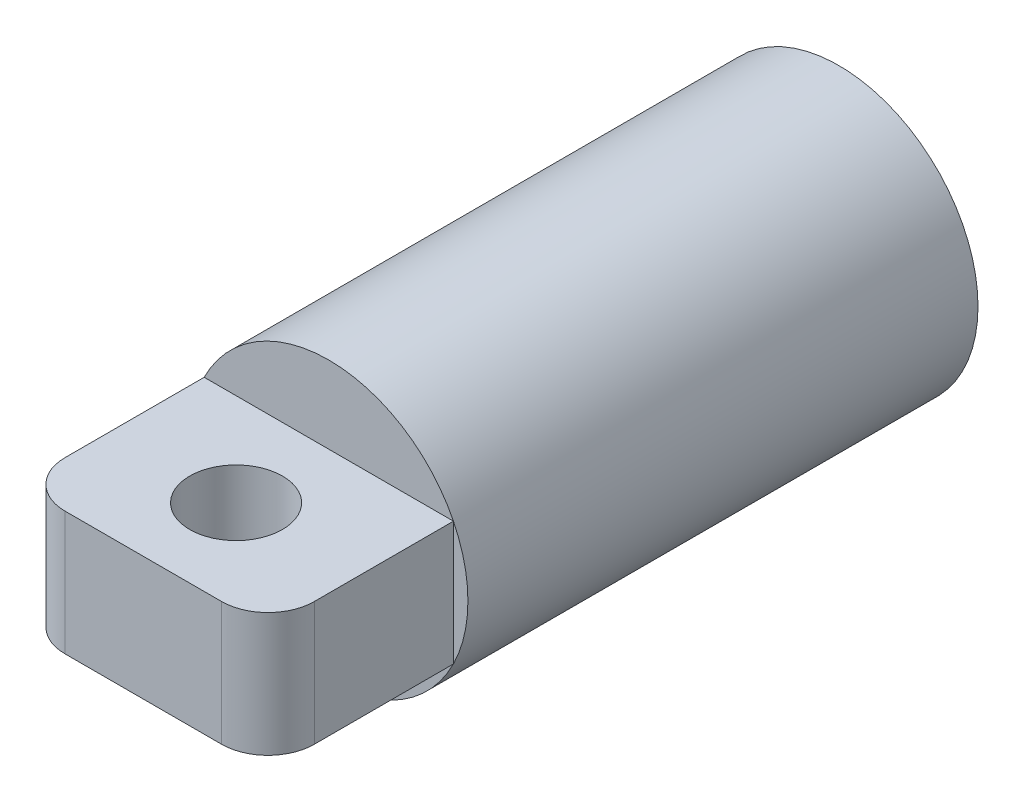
from build123d import *

# Parameters (mm, degrees)
SKETCH1_R           = 9
BOSS_EXTRUDE1_DEPTH = 45
SKETCH2_OUTSIDE_W   = 30.34
SKETCH2_OUTSIDE_H   = 30.34
SKETCH2_OUTSIDE_W_2 = 16.124515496
SKETCH2_OUTSIDE_H_2 = 8
CUT_EXTRUDE1_DEPTH  = 12
FILLET2_R           = 3
SKETCH4_R           = 3
CUT_EXTRUDE2_DEPTH  = 8


with BuildPart() as part:
    # Sketch1 → Boss-Extrude1 (new body)
    with BuildSketch(Plane.XY):
        with Locations(Location((0, 0, 0), (0, 0, 180))):
            Circle(SKETCH1_R)
    extrude(amount=BOSS_EXTRUDE1_DEPTH)

    # Sketch2 outside → Cut-Extrude1 (cut)
    with BuildSketch(Plane.XY.offset(45)):
        Rectangle(SKETCH2_OUTSIDE_W, SKETCH2_OUTSIDE_H)
        Rectangle(SKETCH2_OUTSIDE_W_2, SKETCH2_OUTSIDE_H_2, mode=Mode.SUBTRACT)
    extrude(amount=-CUT_EXTRUDE1_DEPTH, mode=Mode.SUBTRACT)

    # Fillet2
    fillet2_edges = [part.edges().sort_by_distance(p)[0] for p in [
        (8.062257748, 0, 45),
        (-8.062257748, 0, 45),
    ]]
    fillet(fillet2_edges, radius=FILLET2_R)

    # Sketch4 → Cut-Extrude2 (cut)
    with BuildSketch(Plane.XZ.offset(4)):
        with Locations(Location((0, 39, 0), (0, 0, 270))):
            Circle(SKETCH4_R)
    extrude(amount=-CUT_EXTRUDE2_DEPTH, mode=Mode.SUBTRACT)


solid = part.part
